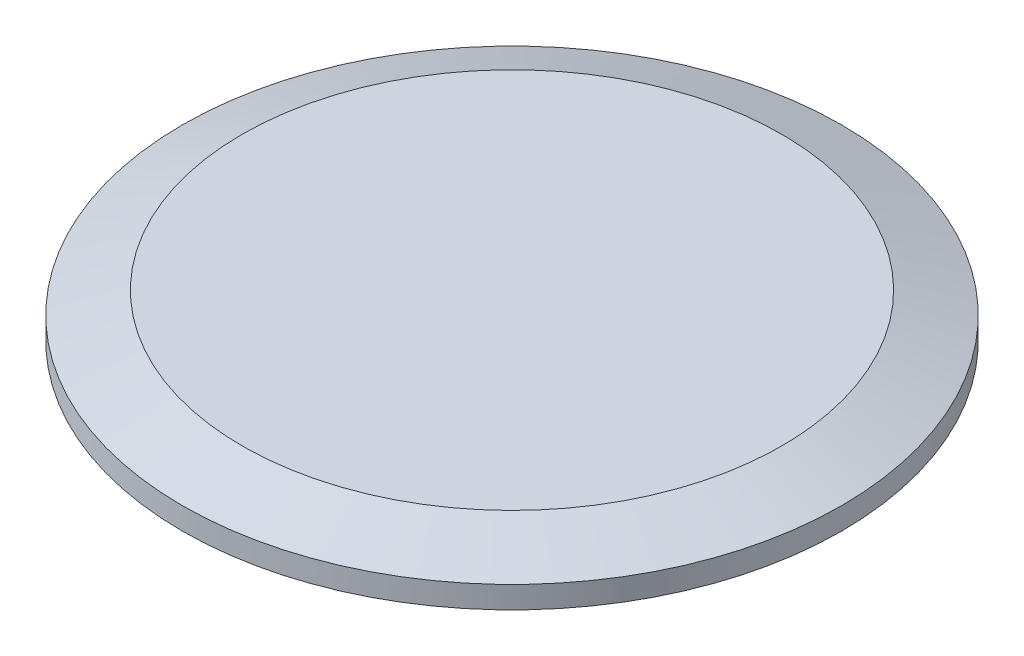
ISO-10303-21;
HEADER;
FILE_DESCRIPTION(('STEP AP214'),'2;1');
FILE_NAME('part.step','',(''),(''),'','','');
FILE_SCHEMA(('AUTOMOTIVE_DESIGN { 1 0 10303 214 1 1 1 1 }'));
ENDSEC;
DATA;
#1=APPLICATION_CONTEXT('core data for automotive mechanical design processes');
#2=APPLICATION_PROTOCOL_DEFINITION('international standard','automotive_design',2000,#1);
#3=PRODUCT_CONTEXT('',#1,'mechanical');
#4=PRODUCT('Part','Part','',(#3));
#5=PRODUCT_RELATED_PRODUCT_CATEGORY('part','',(#4));
#6=PRODUCT_DEFINITION_FORMATION('','',#4);
#7=PRODUCT_DEFINITION_CONTEXT('part definition',#1,'design');
#8=PRODUCT_DEFINITION('design','',#6,#7);
#9=PRODUCT_DEFINITION_SHAPE('','',#8);
#10=(LENGTH_UNIT() NAMED_UNIT(*) SI_UNIT(.MILLI.,.METRE.));
#11=(NAMED_UNIT(*) PLANE_ANGLE_UNIT() SI_UNIT($,.RADIAN.));
#12=(NAMED_UNIT(*) SI_UNIT($,.STERADIAN.) SOLID_ANGLE_UNIT());
#13=UNCERTAINTY_MEASURE_WITH_UNIT(LENGTH_MEASURE(1.E-05),#10,'distance_accuracy_value','');
#14=(GEOMETRIC_REPRESENTATION_CONTEXT(3) GLOBAL_UNCERTAINTY_ASSIGNED_CONTEXT((#13)) GLOBAL_UNIT_ASSIGNED_CONTEXT((#10,
#11,#12)) REPRESENTATION_CONTEXT('',''));
#15=CARTESIAN_POINT('',(0.,0.,0.));
#16=DIRECTION('',(0.,0.,1.));
#17=DIRECTION('',(1.,0.,0.));
#18=AXIS2_PLACEMENT_3D('',#15,#16,#17);
#19=CARTESIAN_POINT('',(-68.29545395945,11.0998,0.));
#20=DIRECTION('',(0.,1.,0.));
#21=DIRECTION('',(-1.,0.,0.));
#22=AXIS2_PLACEMENT_3D('',#19,#20,#21);
#23=PLANE('',#22);
#24=CARTESIAN_POINT('',(0.,11.0998,0.));
#25=DIRECTION('',(0.,1.,0.));
#26=DIRECTION('',(-1.,0.,0.));
#27=AXIS2_PLACEMENT_3D('',#24,#25,#26);
#28=CIRCLE('',#27,68.29545395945);
#29=CARTESIAN_POINT('',(-68.29545395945,11.0998,0.));
#30=VERTEX_POINT('',#29);
#31=EDGE_CURVE('E10',#30,#30,#28,.T.);
#32=ORIENTED_EDGE('',*,*,#31,.T.);
#33=EDGE_LOOP('',(#32));
#34=FACE_BOUND('',#33,.T.);
#35=ADVANCED_FACE('F30',(#34),#23,.T.);
#36=CARTESIAN_POINT('',(0.,11.0998,0.));
#37=DIRECTION('',(0.,-1.,0.));
#38=DIRECTION('',(1.,0.,0.));
#39=AXIS2_PLACEMENT_3D('',#36,#37,#38);
#40=CONICAL_SURFACE('',#39,68.29545395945,1.22173047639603);
#41=CARTESIAN_POINT('',(0.,5.588,0.));
#42=DIRECTION('',(0.,1.,0.));
#43=DIRECTION('',(-1.,0.,0.));
#44=AXIS2_PLACEMENT_3D('',#41,#42,#43);
#45=CIRCLE('',#44,83.439);
#46=CARTESIAN_POINT('',(-83.439,5.58799999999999,0.));
#47=VERTEX_POINT('',#46);
#48=EDGE_CURVE('E36',#47,#47,#45,.T.);
#49=ORIENTED_EDGE('',*,*,#48,.T.);
#50=EDGE_LOOP('',(#49));
#51=FACE_BOUND('',#50,.T.);
#52=ORIENTED_EDGE('',*,*,#31,.F.);
#53=EDGE_LOOP('',(#52));
#54=FACE_BOUND('',#53,.T.);
#55=ADVANCED_FACE('F71',(#51,#54),#40,.T.);
#56=CARTESIAN_POINT('',(0.,11.0998,0.));
#57=DIRECTION('',(0.,1.,0.));
#58=DIRECTION('',(-1.,0.,0.));
#59=AXIS2_PLACEMENT_3D('',#56,#57,#58);
#60=CYLINDRICAL_SURFACE('',#59,83.439);
#61=CARTESIAN_POINT('',(0.,0.,0.));
#62=DIRECTION('',(0.,1.,0.));
#63=DIRECTION('',(-1.,0.,0.));
#64=AXIS2_PLACEMENT_3D('',#61,#62,#63);
#65=CIRCLE('',#64,83.439);
#66=CARTESIAN_POINT('',(-83.439,0.,0.));
#67=VERTEX_POINT('',#66);
#68=EDGE_CURVE('E40',#67,#67,#65,.T.);
#69=ORIENTED_EDGE('',*,*,#68,.T.);
#70=EDGE_LOOP('',(#69));
#71=FACE_BOUND('',#70,.T.);
#72=ORIENTED_EDGE('',*,*,#48,.F.);
#73=EDGE_LOOP('',(#72));
#74=FACE_BOUND('',#73,.T.);
#75=ADVANCED_FACE('F75',(#71,#74),#60,.T.);
#76=CARTESIAN_POINT('',(-79.9992084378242,0.,0.));
#77=DIRECTION('',(0.,-1.,0.));
#78=DIRECTION('',(1.,0.,0.));
#79=AXIS2_PLACEMENT_3D('',#76,#77,#78);
#80=PLANE('',#79);
#81=CARTESIAN_POINT('',(0.,0.,0.));
#82=DIRECTION('',(0.,1.,0.));
#83=DIRECTION('',(-1.,0.,0.));
#84=AXIS2_PLACEMENT_3D('',#81,#82,#83);
#85=CIRCLE('',#84,79.9992084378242);
#86=CARTESIAN_POINT('',(-79.9992084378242,0.,0.));
#87=VERTEX_POINT('',#86);
#88=EDGE_CURVE('E44',#87,#87,#85,.T.);
#89=ORIENTED_EDGE('',*,*,#88,.T.);
#90=EDGE_LOOP('',(#89));
#91=FACE_BOUND('',#90,.T.);
#92=ORIENTED_EDGE('',*,*,#68,.F.);
#93=EDGE_LOOP('',(#92));
#94=FACE_BOUND('',#93,.T.);
#95=ADVANCED_FACE('F79',(#91,#94),#80,.T.);
#96=CARTESIAN_POINT('',(0.,0.787400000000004,0.));
#97=DIRECTION('',(0.,1.,0.));
#98=DIRECTION('',(-1.,0.,0.));
#99=AXIS2_PLACEMENT_3D('',#96,#97,#98);
#100=TOROIDAL_SURFACE('',#99,79.9992084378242,0.787399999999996);
#101=CARTESIAN_POINT('',(0.,0.474458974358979,0.));
#102=DIRECTION('',(0.,1.,0.));
#103=DIRECTION('',(-1.,0.,0.));
#104=AXIS2_PLACEMENT_3D('',#101,#102,#103);
#105=CIRCLE('',#104,79.2766666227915);
#106=CARTESIAN_POINT('',(-79.2766666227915,0.474458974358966,0.));
#107=VERTEX_POINT('',#106);
#108=EDGE_CURVE('E49',#107,#107,#105,.T.);
#109=ORIENTED_EDGE('',*,*,#108,.T.);
#110=EDGE_LOOP('',(#109));
#111=FACE_BOUND('',#110,.T.);
#112=ORIENTED_EDGE('',*,*,#88,.F.);
#113=EDGE_LOOP('',(#112));
#114=FACE_BOUND('',#113,.T.);
#115=ADVANCED_FACE('F86',(#111,#114),#100,.T.);
#116=CARTESIAN_POINT('',(0.,0.,0.));
#117=DIRECTION('',(0.,1.,0.));
#118=DIRECTION('',(-1.,0.,0.));
#119=AXIS2_PLACEMENT_3D('',#116,#117,#118);
#120=TOROIDAL_SURFACE('',#119,78.1812,1.19380000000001);
#121=CARTESIAN_POINT('',(0.,0.474458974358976,0.));
#122=DIRECTION('',(0.,1.,0.));
#123=DIRECTION('',(-1.,0.,0.));
#124=AXIS2_PLACEMENT_3D('',#121,#122,#123);
#125=CIRCLE('',#124,77.0857333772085);
#126=CARTESIAN_POINT('',(-77.0857333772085,0.474458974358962,0.));
#127=VERTEX_POINT('',#126);
#128=EDGE_CURVE('E52',#127,#127,#125,.T.);
#129=ORIENTED_EDGE('',*,*,#128,.T.);
#130=EDGE_LOOP('',(#129));
#131=FACE_BOUND('',#130,.T.);
#132=ORIENTED_EDGE('',*,*,#108,.F.);
#133=EDGE_LOOP('',(#132));
#134=FACE_BOUND('',#133,.T.);
#135=ADVANCED_FACE('F68',(#131,#134),#120,.F.);
#136=CARTESIAN_POINT('',(0.,0.787400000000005,0.));
#137=DIRECTION('',(0.,1.,0.));
#138=DIRECTION('',(-1.,0.,0.));
#139=AXIS2_PLACEMENT_3D('',#136,#137,#138);
#140=TOROIDAL_SURFACE('',#139,76.3631915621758,0.787399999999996);
#141=CARTESIAN_POINT('',(0.,0.,0.));
#142=DIRECTION('',(0.,1.,0.));
#143=DIRECTION('',(-1.,0.,0.));
#144=AXIS2_PLACEMENT_3D('',#141,#142,#143);
#145=CIRCLE('',#144,76.3631915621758);
#146=CARTESIAN_POINT('',(-76.3631915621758,0.,0.));
#147=VERTEX_POINT('',#146);
#148=EDGE_CURVE('E55',#147,#147,#145,.T.);
#149=ORIENTED_EDGE('',*,*,#148,.T.);
#150=EDGE_LOOP('',(#149));
#151=FACE_BOUND('',#150,.T.);
#152=ORIENTED_EDGE('',*,*,#128,.F.);
#153=EDGE_LOOP('',(#152));
#154=FACE_BOUND('',#153,.T.);
#155=ADVANCED_FACE('F59',(#151,#154),#140,.T.);
#156=CARTESIAN_POINT('',(0.,0.,0.));
#157=DIRECTION('',(0.,-1.,0.));
#158=DIRECTION('',(1.,0.,0.));
#159=AXIS2_PLACEMENT_3D('',#156,#157,#158);
#160=PLANE('',#159);
#161=ORIENTED_EDGE('',*,*,#148,.F.);
#162=EDGE_LOOP('',(#161));
#163=FACE_BOUND('',#162,.T.);
#164=ADVANCED_FACE('F62',(#163),#160,.T.);
#165=CLOSED_SHELL('',(#35,#55,#75,#95,#115,#135,#155,#164));
#166=MANIFOLD_SOLID_BREP('B2',#165);
#167=ADVANCED_BREP_SHAPE_REPRESENTATION('',(#18,#166),#14);
#168=SHAPE_DEFINITION_REPRESENTATION(#9,#167);
ENDSEC;
END-ISO-10303-21;
